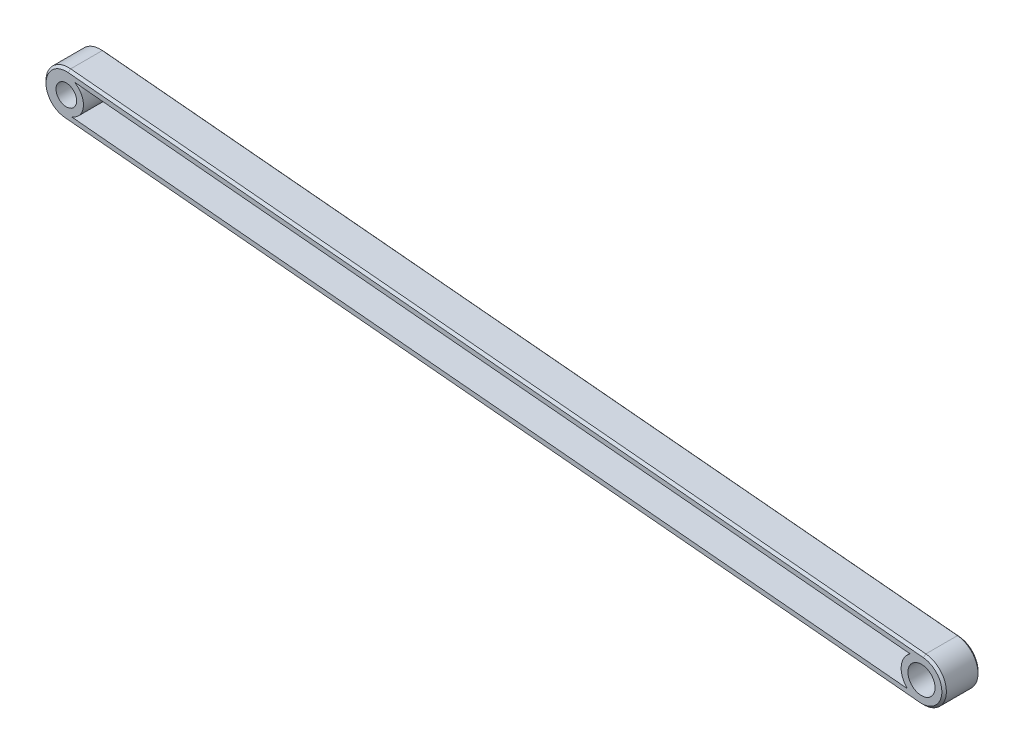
ISO-10303-21;
HEADER;
FILE_DESCRIPTION(('STEP AP214'),'2;1');
FILE_NAME('part.step','',(''),(''),'','','');
FILE_SCHEMA(('AUTOMOTIVE_DESIGN { 1 0 10303 214 1 1 1 1 }'));
ENDSEC;
DATA;
#1=APPLICATION_CONTEXT('core data for automotive mechanical design processes');
#2=APPLICATION_PROTOCOL_DEFINITION('international standard','automotive_design',2000,#1);
#3=PRODUCT_CONTEXT('',#1,'mechanical');
#4=PRODUCT('Part','Part','',(#3));
#5=PRODUCT_RELATED_PRODUCT_CATEGORY('part','',(#4));
#6=PRODUCT_DEFINITION_FORMATION('','',#4);
#7=PRODUCT_DEFINITION_CONTEXT('part definition',#1,'design');
#8=PRODUCT_DEFINITION('design','',#6,#7);
#9=PRODUCT_DEFINITION_SHAPE('','',#8);
#10=(LENGTH_UNIT() NAMED_UNIT(*) SI_UNIT(.MILLI.,.METRE.));
#11=(NAMED_UNIT(*) PLANE_ANGLE_UNIT() SI_UNIT($,.RADIAN.));
#12=(NAMED_UNIT(*) SI_UNIT($,.STERADIAN.) SOLID_ANGLE_UNIT());
#13=UNCERTAINTY_MEASURE_WITH_UNIT(LENGTH_MEASURE(1.E-05),#10,'distance_accuracy_value','');
#14=(GEOMETRIC_REPRESENTATION_CONTEXT(3) GLOBAL_UNCERTAINTY_ASSIGNED_CONTEXT((#13)) GLOBAL_UNIT_ASSIGNED_CONTEXT((#10,
#11,#12)) REPRESENTATION_CONTEXT('',''));
#15=CARTESIAN_POINT('',(0.,0.,0.));
#16=DIRECTION('',(0.,0.,1.));
#17=DIRECTION('',(1.,0.,0.));
#18=AXIS2_PLACEMENT_3D('',#15,#16,#17);
#19=CARTESIAN_POINT('',(517.920389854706,929.84012062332,15.9999999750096));
#20=DIRECTION('',(0.,0.,1.));
#21=DIRECTION('',(0.999913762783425,-0.0131326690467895,0.));
#22=AXIS2_PLACEMENT_3D('',#19,#20,#21);
#23=PLANE('',#22);
#24=CARTESIAN_POINT('',(139.534710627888,964.829738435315,15.9999999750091));
#25=DIRECTION('',(0.,0.,1.));
#26=DIRECTION('',(0.,-1.,0.));
#27=AXIS2_PLACEMENT_3D('',#24,#25,#26);
#28=CIRCLE('',#27,9.00000000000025);
#29=CARTESIAN_POINT('',(140.363412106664,973.791504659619,15.9999999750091));
#30=VERTEX_POINT('',#29);
#31=CARTESIAN_POINT('',(138.706009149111,955.867972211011,15.999999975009));
#32=VERTEX_POINT('',#31);
#33=EDGE_CURVE('E34',#30,#32,#28,.T.);
#34=ORIENTED_EDGE('',*,*,#33,.T.);
#35=DIRECTION('',(0.99575180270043,-0.0920779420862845,0.));
#36=VECTOR('',#35,1.);
#37=CARTESIAN_POINT('',(517.091694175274,920.878354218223,15.9999999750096));
#38=LINE('',#37,#36);
#39=CARTESIAN_POINT('',(517.091694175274,920.878354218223,15.9999999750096));
#40=VERTEX_POINT('',#39);
#41=EDGE_CURVE('E11',#32,#40,#38,.T.);
#42=ORIENTED_EDGE('',*,*,#41,.T.);
#43=CARTESIAN_POINT('',(517.920395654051,929.840120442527,15.9999999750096));
#44=DIRECTION('',(0.,0.,1.));
#45=DIRECTION('',(0.,-1.,0.));
#46=AXIS2_PLACEMENT_3D('',#43,#44,#45);
#47=CIRCLE('',#46,9.00000000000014);
#48=CARTESIAN_POINT('',(518.749097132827,938.801886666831,15.9999999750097));
#49=VERTEX_POINT('',#48);
#50=EDGE_CURVE('E214',#40,#49,#47,.T.);
#51=ORIENTED_EDGE('',*,*,#50,.T.);
#52=DIRECTION('',(-0.99575180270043,0.0920779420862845,0.));
#53=VECTOR('',#52,1.);
#54=CARTESIAN_POINT('',(140.363412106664,973.791504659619,15.9999999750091));
#55=LINE('',#54,#53);
#56=EDGE_CURVE('E212',#49,#30,#55,.T.);
#57=ORIENTED_EDGE('',*,*,#56,.T.);
#58=EDGE_LOOP('',(#34,#42,#51,#57));
#59=FACE_BOUND('',#58,.T.);
#60=CARTESIAN_POINT('',(139.534710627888,964.829738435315,15.9999999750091));
#61=DIRECTION('',(0.,0.,1.));
#62=DIRECTION('',(0.,-1.,0.));
#63=AXIS2_PLACEMENT_3D('',#60,#61,#62);
#64=CIRCLE('',#63,4.57379055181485);
#65=CARTESIAN_POINT('',(139.534710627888,960.2559478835,15.9999999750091));
#66=VERTEX_POINT('',#65);
#67=EDGE_CURVE('E162',#66,#66,#64,.T.);
#68=ORIENTED_EDGE('',*,*,#67,.F.);
#69=EDGE_LOOP('',(#68));
#70=FACE_BOUND('',#69,.T.);
#71=CARTESIAN_POINT('',(517.920395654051,929.840120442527,15.9999999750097));
#72=DIRECTION('',(0.,0.,1.));
#73=DIRECTION('',(0.,-1.,0.));
#74=AXIS2_PLACEMENT_3D('',#71,#72,#73);
#75=CIRCLE('',#74,5.99999999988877);
#76=CARTESIAN_POINT('',(517.920395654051,923.840120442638,15.9999999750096));
#77=VERTEX_POINT('',#76);
#78=EDGE_CURVE('E161',#77,#77,#75,.T.);
#79=ORIENTED_EDGE('',*,*,#78,.F.);
#80=EDGE_LOOP('',(#79));
#81=FACE_BOUND('',#80,.T.);
#82=DIRECTION('',(-0.99575180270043,0.0920779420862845,0.));
#83=VECTOR('',#82,1.);
#84=CARTESIAN_POINT('',(140.179256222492,971.800001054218,15.9999999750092));
#85=LINE('',#84,#83);
#86=CARTESIAN_POINT('',(512.932118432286,937.331254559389,15.9999999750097));
#87=VERTEX_POINT('',#86);
#88=CARTESIAN_POINT('',(143.05873617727,971.533733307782,15.9999999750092));
#89=VERTEX_POINT('',#88);
#90=EDGE_CURVE('E147',#87,#89,#85,.T.);
#91=ORIENTED_EDGE('',*,*,#90,.F.);
#92=CARTESIAN_POINT('',(517.920395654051,929.840120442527,15.9999999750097));
#93=DIRECTION('',(0.,0.,1.));
#94=DIRECTION('',(0.,-1.,0.));
#95=AXIS2_PLACEMENT_3D('',#92,#93,#94);
#96=CIRCLE('',#95,8.99999999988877);
#97=CARTESIAN_POINT('',(511.643027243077,923.390729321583,15.9999999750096));
#98=VERTEX_POINT('',#97);
#99=EDGE_CURVE('E154',#87,#98,#96,.T.);
#100=ORIENTED_EDGE('',*,*,#99,.T.);
#101=DIRECTION('',(0.99575180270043,-0.0920779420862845,0.));
#102=VECTOR('',#101,1.);
#103=CARTESIAN_POINT('',(138.890165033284,957.859475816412,15.9999999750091));
#104=LINE('',#103,#102);
#105=CARTESIAN_POINT('',(141.769644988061,957.593208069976,15.9999999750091));
#106=VERTEX_POINT('',#105);
#107=EDGE_CURVE('E123',#106,#98,#104,.T.);
#108=ORIENTED_EDGE('',*,*,#107,.F.);
#109=CARTESIAN_POINT('',(139.534710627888,964.829738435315,15.9999999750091));
#110=DIRECTION('',(0.,0.,1.));
#111=DIRECTION('',(0.,-1.,0.));
#112=AXIS2_PLACEMENT_3D('',#109,#110,#111);
#113=CIRCLE('',#112,7.57379055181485);
#114=EDGE_CURVE('E150',#106,#89,#113,.T.);
#115=ORIENTED_EDGE('',*,*,#114,.T.);
#116=EDGE_LOOP('',(#91,#100,#108,#115));
#117=FACE_BOUND('',#116,.T.);
#118=ADVANCED_FACE('F26',(#59,#70,#81,#117),#23,.T.);
#119=CARTESIAN_POINT('',(140.45549004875,974.787256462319,418.162917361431));
#120=DIRECTION('',(-0.0920779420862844,-0.995751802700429,0.));
#121=DIRECTION('',(0.99575180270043,-0.0920779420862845,0.));
#122=AXIS2_PLACEMENT_3D('',#119,#120,#121);
#123=PLANE('',#122);
#124=DIRECTION('',(0.,0.,-1.));
#125=VECTOR('',#124,1.);
#126=CARTESIAN_POINT('',(518.841175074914,939.797638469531,418.162917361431));
#127=LINE('',#126,#125);
#128=CARTESIAN_POINT('',(518.841175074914,939.797638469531,14.9999999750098));
#129=VERTEX_POINT('',#128);
#130=CARTESIAN_POINT('',(518.841175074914,939.797638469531,1.));
#131=VERTEX_POINT('',#130);
#132=EDGE_CURVE('E174',#129,#131,#127,.T.);
#133=ORIENTED_EDGE('',*,*,#132,.T.);
#134=DIRECTION('',(-0.99575180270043,0.0920779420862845,0.));
#135=VECTOR('',#134,1.);
#136=CARTESIAN_POINT('',(140.45549004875,974.787256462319,1.));
#137=LINE('',#136,#135);
#138=CARTESIAN_POINT('',(140.45549004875,974.787256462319,1.));
#139=VERTEX_POINT('',#138);
#140=EDGE_CURVE('E210',#131,#139,#137,.T.);
#141=ORIENTED_EDGE('',*,*,#140,.T.);
#142=DIRECTION('',(0.,0.,-1.));
#143=VECTOR('',#142,1.);
#144=CARTESIAN_POINT('',(140.45549004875,974.787256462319,418.162917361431));
#145=LINE('',#144,#143);
#146=CARTESIAN_POINT('',(140.45549004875,974.787256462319,14.9999999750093));
#147=VERTEX_POINT('',#146);
#148=EDGE_CURVE('E171',#147,#139,#145,.T.);
#149=ORIENTED_EDGE('',*,*,#148,.F.);
#150=DIRECTION('',(0.99575180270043,-0.0920779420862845,0.));
#151=VECTOR('',#150,1.);
#152=CARTESIAN_POINT('',(518.841175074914,939.797638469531,14.9999999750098));
#153=LINE('',#152,#151);
#154=EDGE_CURVE('E208',#147,#129,#153,.T.);
#155=ORIENTED_EDGE('',*,*,#154,.T.);
#156=EDGE_LOOP('',(#133,#141,#149,#155));
#157=FACE_BOUND('',#156,.T.);
#158=ADVANCED_FACE('F273',(#157),#123,.F.);
#159=CARTESIAN_POINT('',(517.920395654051,929.840120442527,418.162917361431));
#160=DIRECTION('',(0.,0.,-1.));
#161=DIRECTION('',(-1.,0.,0.));
#162=AXIS2_PLACEMENT_3D('',#159,#160,#161);
#163=CYLINDRICAL_SURFACE('',#162,9.99999999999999);
#164=DIRECTION('',(0.,0.,-1.));
#165=VECTOR('',#164,1.);
#166=CARTESIAN_POINT('',(516.999616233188,919.882602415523,418.162917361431));
#167=LINE('',#166,#165);
#168=CARTESIAN_POINT('',(516.999616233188,919.882602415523,14.9999999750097));
#169=VERTEX_POINT('',#168);
#170=CARTESIAN_POINT('',(516.999616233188,919.882602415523,1.));
#171=VERTEX_POINT('',#170);
#172=EDGE_CURVE('E177',#169,#171,#167,.T.);
#173=ORIENTED_EDGE('',*,*,#172,.T.);
#174=CARTESIAN_POINT('',(517.920395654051,929.840120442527,1.));
#175=DIRECTION('',(0.,0.,1.));
#176=DIRECTION('',(1.,0.,0.));
#177=AXIS2_PLACEMENT_3D('',#174,#175,#176);
#178=CIRCLE('',#177,9.99999999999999);
#179=EDGE_CURVE('E206',#171,#131,#178,.T.);
#180=ORIENTED_EDGE('',*,*,#179,.T.);
#181=ORIENTED_EDGE('',*,*,#132,.F.);
#182=CARTESIAN_POINT('',(517.920395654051,929.840120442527,14.9999999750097));
#183=DIRECTION('',(0.,0.,1.));
#184=DIRECTION('',(1.,0.,0.));
#185=AXIS2_PLACEMENT_3D('',#182,#183,#184);
#186=CIRCLE('',#185,9.99999999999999);
#187=EDGE_CURVE('E204',#129,#169,#186,.F.);
#188=ORIENTED_EDGE('',*,*,#187,.T.);
#189=EDGE_LOOP('',(#173,#180,#181,#188));
#190=FACE_BOUND('',#189,.T.);
#191=ADVANCED_FACE('F271',(#190),#163,.T.);
#192=CARTESIAN_POINT('',(138.613931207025,954.872220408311,418.162917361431));
#193=DIRECTION('',(0.0920779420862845,0.995751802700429,0.));
#194=DIRECTION('',(-0.99575180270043,0.0920779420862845,0.));
#195=AXIS2_PLACEMENT_3D('',#192,#193,#194);
#196=PLANE('',#195);
#197=DIRECTION('',(0.,0.,-1.));
#198=VECTOR('',#197,1.);
#199=CARTESIAN_POINT('',(138.613931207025,954.872220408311,418.162917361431));
#200=LINE('',#199,#198);
#201=CARTESIAN_POINT('',(138.613931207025,954.872220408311,14.9999999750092));
#202=VERTEX_POINT('',#201);
#203=CARTESIAN_POINT('',(138.613931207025,954.872220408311,1.));
#204=VERTEX_POINT('',#203);
#205=EDGE_CURVE('E180',#202,#204,#200,.T.);
#206=ORIENTED_EDGE('',*,*,#205,.T.);
#207=DIRECTION('',(0.99575180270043,-0.0920779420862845,0.));
#208=VECTOR('',#207,1.);
#209=CARTESIAN_POINT('',(138.613931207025,954.872220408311,1.));
#210=LINE('',#209,#208);
#211=EDGE_CURVE('E188',#204,#171,#210,.T.);
#212=ORIENTED_EDGE('',*,*,#211,.T.);
#213=ORIENTED_EDGE('',*,*,#172,.F.);
#214=DIRECTION('',(-0.99575180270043,0.0920779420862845,0.));
#215=VECTOR('',#214,1.);
#216=CARTESIAN_POINT('',(138.613931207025,954.872220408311,14.9999999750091));
#217=LINE('',#216,#215);
#218=EDGE_CURVE('E183',#169,#202,#217,.T.);
#219=ORIENTED_EDGE('',*,*,#218,.T.);
#220=EDGE_LOOP('',(#206,#212,#213,#219));
#221=FACE_BOUND('',#220,.T.);
#222=ADVANCED_FACE('F269',(#221),#196,.F.);
#223=CARTESIAN_POINT('',(139.534710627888,964.829738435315,418.162917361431));
#224=DIRECTION('',(0.,0.,-1.));
#225=DIRECTION('',(-1.,0.,0.));
#226=AXIS2_PLACEMENT_3D('',#223,#224,#225);
#227=CYLINDRICAL_SURFACE('',#226,9.99999999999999);
#228=ORIENTED_EDGE('',*,*,#148,.T.);
#229=CARTESIAN_POINT('',(139.534710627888,964.829738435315,1.));
#230=DIRECTION('',(0.,0.,1.));
#231=DIRECTION('',(1.,0.,0.));
#232=AXIS2_PLACEMENT_3D('',#229,#230,#231);
#233=CIRCLE('',#232,9.99999999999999);
#234=EDGE_CURVE('E202',#139,#204,#233,.T.);
#235=ORIENTED_EDGE('',*,*,#234,.T.);
#236=ORIENTED_EDGE('',*,*,#205,.F.);
#237=CARTESIAN_POINT('',(139.534710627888,964.829738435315,14.9999999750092));
#238=DIRECTION('',(0.,0.,1.));
#239=DIRECTION('',(1.,0.,0.));
#240=AXIS2_PLACEMENT_3D('',#237,#238,#239);
#241=CIRCLE('',#240,9.99999999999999);
#242=EDGE_CURVE('E200',#202,#147,#241,.F.);
#243=ORIENTED_EDGE('',*,*,#242,.T.);
#244=EDGE_LOOP('',(#228,#235,#236,#243));
#245=FACE_BOUND('',#244,.T.);
#246=ADVANCED_FACE('F28',(#245),#227,.T.);
#247=CARTESIAN_POINT('',(139.534710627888,964.829738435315,418.162917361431));
#248=DIRECTION('',(0.,0.,-1.));
#249=DIRECTION('',(-1.,0.,0.));
#250=AXIS2_PLACEMENT_3D('',#247,#248,#249);
#251=CYLINDRICAL_SURFACE('',#250,4.57379055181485);
#252=CARTESIAN_POINT('',(139.534710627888,964.829738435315,0.));
#253=DIRECTION('',(0.,0.,1.));
#254=DIRECTION('',(1.,0.,0.));
#255=AXIS2_PLACEMENT_3D('',#252,#253,#254);
#256=CIRCLE('',#255,4.57379055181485);
#257=CARTESIAN_POINT('',(144.108501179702,964.829738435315,0.));
#258=VERTEX_POINT('',#257);
#259=EDGE_CURVE('E168',#258,#258,#256,.T.);
#260=ORIENTED_EDGE('',*,*,#259,.F.);
#261=EDGE_LOOP('',(#260));
#262=FACE_BOUND('',#261,.T.);
#263=ORIENTED_EDGE('',*,*,#67,.T.);
#264=EDGE_LOOP('',(#263));
#265=FACE_BOUND('',#264,.T.);
#266=ADVANCED_FACE('F300',(#262,#265),#251,.F.);
#267=CARTESIAN_POINT('',(139.534710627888,964.829738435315,0.));
#268=DIRECTION('',(0.,0.,1.));
#269=DIRECTION('',(1.,0.,0.));
#270=AXIS2_PLACEMENT_3D('',#267,#268,#269);
#271=PLANE('',#270);
#272=CARTESIAN_POINT('',(517.920395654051,929.840120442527,0.));
#273=DIRECTION('',(0.,0.,1.));
#274=DIRECTION('',(1.,0.,0.));
#275=AXIS2_PLACEMENT_3D('',#272,#273,#274);
#276=CIRCLE('',#275,8.99999999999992);
#277=CARTESIAN_POINT('',(518.749097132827,938.801886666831,0.));
#278=VERTEX_POINT('',#277);
#279=CARTESIAN_POINT('',(517.091694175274,920.878354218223,0.));
#280=VERTEX_POINT('',#279);
#281=EDGE_CURVE('E193',#278,#280,#276,.F.);
#282=ORIENTED_EDGE('',*,*,#281,.T.);
#283=DIRECTION('',(-0.99575180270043,0.0920779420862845,0.));
#284=VECTOR('',#283,1.);
#285=CARTESIAN_POINT('',(138.706009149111,955.867972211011,0.));
#286=LINE('',#285,#284);
#287=CARTESIAN_POINT('',(138.706009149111,955.867972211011,0.));
#288=VERTEX_POINT('',#287);
#289=EDGE_CURVE('E197',#280,#288,#286,.T.);
#290=ORIENTED_EDGE('',*,*,#289,.T.);
#291=CARTESIAN_POINT('',(139.534710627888,964.829738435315,0.));
#292=DIRECTION('',(0.,0.,1.));
#293=DIRECTION('',(1.,0.,0.));
#294=AXIS2_PLACEMENT_3D('',#291,#292,#293);
#295=CIRCLE('',#294,8.99999999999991);
#296=CARTESIAN_POINT('',(140.363412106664,973.791504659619,0.));
#297=VERTEX_POINT('',#296);
#298=EDGE_CURVE('E195',#288,#297,#295,.F.);
#299=ORIENTED_EDGE('',*,*,#298,.T.);
#300=DIRECTION('',(0.99575180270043,-0.0920779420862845,0.));
#301=VECTOR('',#300,1.);
#302=CARTESIAN_POINT('',(140.363412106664,973.791504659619,0.));
#303=LINE('',#302,#301);
#304=EDGE_CURVE('E191',#297,#278,#303,.T.);
#305=ORIENTED_EDGE('',*,*,#304,.T.);
#306=EDGE_LOOP('',(#282,#290,#299,#305));
#307=FACE_BOUND('',#306,.T.);
#308=ORIENTED_EDGE('',*,*,#259,.T.);
#309=EDGE_LOOP('',(#308));
#310=FACE_BOUND('',#309,.T.);
#311=CARTESIAN_POINT('',(517.920395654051,929.840120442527,0.));
#312=DIRECTION('',(0.,0.,1.));
#313=DIRECTION('',(1.,0.,0.));
#314=AXIS2_PLACEMENT_3D('',#311,#312,#313);
#315=CIRCLE('',#314,5.99999999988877);
#316=CARTESIAN_POINT('',(523.920395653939,929.840120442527,0.));
#317=VERTEX_POINT('',#316);
#318=EDGE_CURVE('E165',#317,#317,#315,.T.);
#319=ORIENTED_EDGE('',*,*,#318,.T.);
#320=EDGE_LOOP('',(#319));
#321=FACE_BOUND('',#320,.T.);
#322=ADVANCED_FACE('F255',(#307,#310,#321),#271,.F.);
#323=CARTESIAN_POINT('',(517.920395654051,929.840120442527,418.162917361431));
#324=DIRECTION('',(0.,0.,-1.));
#325=DIRECTION('',(-1.,0.,0.));
#326=AXIS2_PLACEMENT_3D('',#323,#324,#325);
#327=CYLINDRICAL_SURFACE('',#326,5.99999999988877);
#328=ORIENTED_EDGE('',*,*,#318,.F.);
#329=EDGE_LOOP('',(#328));
#330=FACE_BOUND('',#329,.T.);
#331=ORIENTED_EDGE('',*,*,#78,.T.);
#332=EDGE_LOOP('',(#331));
#333=FACE_BOUND('',#332,.T.);
#334=ADVANCED_FACE('F295',(#330,#333),#327,.F.);
#335=CARTESIAN_POINT('',(140.179256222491,971.800001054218,418.162917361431));
#336=DIRECTION('',(-0.0920779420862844,-0.995751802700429,0.));
#337=DIRECTION('',(0.99575180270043,-0.0920779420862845,0.));
#338=AXIS2_PLACEMENT_3D('',#335,#336,#337);
#339=PLANE('',#338);
#340=DIRECTION('',(-0.99575180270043,0.0920779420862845,0.));
#341=VECTOR('',#340,1.);
#342=CARTESIAN_POINT('',(140.179256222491,971.800001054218,3.));
#343=LINE('',#342,#341);
#344=CARTESIAN_POINT('',(512.932118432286,937.331254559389,3.));
#345=VERTEX_POINT('',#344);
#346=CARTESIAN_POINT('',(143.05873617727,971.533733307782,3.));
#347=VERTEX_POINT('',#346);
#348=EDGE_CURVE('E141',#345,#347,#343,.T.);
#349=ORIENTED_EDGE('',*,*,#348,.F.);
#350=DIRECTION('',(0.,0.,-1.));
#351=VECTOR('',#350,1.);
#352=CARTESIAN_POINT('',(512.932118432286,937.331254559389,418.162917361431));
#353=LINE('',#352,#351);
#354=EDGE_CURVE('E128',#345,#87,#353,.F.);
#355=ORIENTED_EDGE('',*,*,#354,.T.);
#356=ORIENTED_EDGE('',*,*,#90,.T.);
#357=DIRECTION('',(0.,0.,-1.));
#358=VECTOR('',#357,1.);
#359=CARTESIAN_POINT('',(143.05873617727,971.533733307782,418.162917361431));
#360=LINE('',#359,#358);
#361=EDGE_CURVE('E127',#347,#89,#360,.F.);
#362=ORIENTED_EDGE('',*,*,#361,.F.);
#363=EDGE_LOOP('',(#349,#355,#356,#362));
#364=FACE_BOUND('',#363,.T.);
#365=ADVANCED_FACE('F298',(#364),#339,.T.);
#366=CARTESIAN_POINT('',(138.890165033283,957.859475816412,418.162917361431));
#367=DIRECTION('',(0.0920779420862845,0.995751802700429,0.));
#368=DIRECTION('',(-0.99575180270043,0.0920779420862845,0.));
#369=AXIS2_PLACEMENT_3D('',#366,#367,#368);
#370=PLANE('',#369);
#371=DIRECTION('',(0.,0.,-1.));
#372=VECTOR('',#371,1.);
#373=CARTESIAN_POINT('',(141.769644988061,957.593208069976,418.162917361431));
#374=LINE('',#373,#372);
#375=CARTESIAN_POINT('',(141.769644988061,957.593208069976,3.));
#376=VERTEX_POINT('',#375);
#377=EDGE_CURVE('E159',#376,#106,#374,.F.);
#378=ORIENTED_EDGE('',*,*,#377,.T.);
#379=ORIENTED_EDGE('',*,*,#107,.T.);
#380=DIRECTION('',(0.,0.,-1.));
#381=VECTOR('',#380,1.);
#382=CARTESIAN_POINT('',(511.643027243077,923.390729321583,418.162917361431));
#383=LINE('',#382,#381);
#384=CARTESIAN_POINT('',(511.643027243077,923.390729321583,3.));
#385=VERTEX_POINT('',#384);
#386=EDGE_CURVE('E116',#385,#98,#383,.F.);
#387=ORIENTED_EDGE('',*,*,#386,.F.);
#388=DIRECTION('',(0.99575180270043,-0.0920779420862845,0.));
#389=VECTOR('',#388,1.);
#390=CARTESIAN_POINT('',(138.890165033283,957.859475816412,3.));
#391=LINE('',#390,#389);
#392=EDGE_CURVE('E121',#376,#385,#391,.T.);
#393=ORIENTED_EDGE('',*,*,#392,.F.);
#394=EDGE_LOOP('',(#378,#379,#387,#393));
#395=FACE_BOUND('',#394,.T.);
#396=ADVANCED_FACE('F119',(#395),#370,.T.);
#397=CARTESIAN_POINT('',(139.534710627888,964.829738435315,418.162917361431));
#398=DIRECTION('',(0.,0.,-1.));
#399=DIRECTION('',(-1.,0.,0.));
#400=AXIS2_PLACEMENT_3D('',#397,#398,#399);
#401=CYLINDRICAL_SURFACE('',#400,7.57379055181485);
#402=CARTESIAN_POINT('',(139.534710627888,964.829738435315,3.));
#403=DIRECTION('',(0.,0.,1.));
#404=DIRECTION('',(1.,0.,0.));
#405=AXIS2_PLACEMENT_3D('',#402,#403,#404);
#406=CIRCLE('',#405,7.57379055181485);
#407=EDGE_CURVE('E136',#376,#347,#406,.T.);
#408=ORIENTED_EDGE('',*,*,#407,.T.);
#409=ORIENTED_EDGE('',*,*,#361,.T.);
#410=ORIENTED_EDGE('',*,*,#114,.F.);
#411=ORIENTED_EDGE('',*,*,#377,.F.);
#412=EDGE_LOOP('',(#408,#409,#410,#411));
#413=FACE_BOUND('',#412,.T.);
#414=ADVANCED_FACE('F371',(#413),#401,.T.);
#415=CARTESIAN_POINT('',(139.534710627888,964.829738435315,3.));
#416=DIRECTION('',(0.,0.,1.));
#417=DIRECTION('',(1.,0.,0.));
#418=AXIS2_PLACEMENT_3D('',#415,#416,#417);
#419=PLANE('',#418);
#420=ORIENTED_EDGE('',*,*,#407,.F.);
#421=ORIENTED_EDGE('',*,*,#392,.T.);
#422=CARTESIAN_POINT('',(517.920395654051,929.840120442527,3.));
#423=DIRECTION('',(0.,0.,1.));
#424=DIRECTION('',(1.,0.,0.));
#425=AXIS2_PLACEMENT_3D('',#422,#423,#424);
#426=CIRCLE('',#425,8.99999999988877);
#427=EDGE_CURVE('E131',#345,#385,#426,.T.);
#428=ORIENTED_EDGE('',*,*,#427,.F.);
#429=ORIENTED_EDGE('',*,*,#348,.T.);
#430=EDGE_LOOP('',(#420,#421,#428,#429));
#431=FACE_BOUND('',#430,.T.);
#432=ADVANCED_FACE('F139',(#431),#419,.T.);
#433=CARTESIAN_POINT('',(517.920395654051,929.840120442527,418.162917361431));
#434=DIRECTION('',(0.,0.,-1.));
#435=DIRECTION('',(-1.,0.,0.));
#436=AXIS2_PLACEMENT_3D('',#433,#434,#435);
#437=CYLINDRICAL_SURFACE('',#436,8.99999999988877);
#438=ORIENTED_EDGE('',*,*,#386,.T.);
#439=ORIENTED_EDGE('',*,*,#99,.F.);
#440=ORIENTED_EDGE('',*,*,#354,.F.);
#441=ORIENTED_EDGE('',*,*,#427,.T.);
#442=EDGE_LOOP('',(#438,#439,#440,#441));
#443=FACE_BOUND('',#442,.T.);
#444=ADVANCED_FACE('F132',(#443),#437,.T.);
#445=CARTESIAN_POINT('',(140.45549004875,974.787256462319,1.));
#446=DIRECTION('',(-0.0651089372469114,-0.704102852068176,0.707106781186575));
#447=DIRECTION('',(0.,-0.708610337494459,-0.705600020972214));
#448=AXIS2_PLACEMENT_3D('',#445,#446,#447);
#449=PLANE('',#448);
#450=DIRECTION('',(0.0651089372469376,0.704102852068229,0.707106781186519));
#451=VECTOR('',#450,1.);
#452=CARTESIAN_POINT('',(518.749097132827,938.801886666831,0.));
#453=LINE('',#452,#451);
#454=EDGE_CURVE('E239',#278,#131,#453,.T.);
#455=ORIENTED_EDGE('',*,*,#454,.F.);
#456=ORIENTED_EDGE('',*,*,#304,.F.);
#457=DIRECTION('',(-0.065108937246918,-0.70410285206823,-0.70710678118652));
#458=VECTOR('',#457,1.);
#459=CARTESIAN_POINT('',(140.45549004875,974.787256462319,1.));
#460=LINE('',#459,#458);
#461=EDGE_CURVE('E156',#139,#297,#460,.T.);
#462=ORIENTED_EDGE('',*,*,#461,.F.);
#463=ORIENTED_EDGE('',*,*,#140,.F.);
#464=EDGE_LOOP('',(#455,#456,#462,#463));
#465=FACE_BOUND('',#464,.T.);
#466=ADVANCED_FACE('F252',(#465),#449,.F.);
#467=CARTESIAN_POINT('',(139.534710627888,964.829738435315,1.));
#468=DIRECTION('',(0.,0.,1.));
#469=DIRECTION('',(1.,0.,0.));
#470=AXIS2_PLACEMENT_3D('',#467,#468,#469);
#471=CONICAL_SURFACE('',#470,9.99999999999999,0.785398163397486);
#472=ORIENTED_EDGE('',*,*,#461,.T.);
#473=ORIENTED_EDGE('',*,*,#298,.F.);
#474=DIRECTION('',(0.065108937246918,0.70410285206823,-0.70710678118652));
#475=VECTOR('',#474,1.);
#476=CARTESIAN_POINT('',(138.613931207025,954.872220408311,1.));
#477=LINE('',#476,#475);
#478=EDGE_CURVE('E237',#204,#288,#477,.T.);
#479=ORIENTED_EDGE('',*,*,#478,.F.);
#480=ORIENTED_EDGE('',*,*,#234,.F.);
#481=EDGE_LOOP('',(#472,#473,#479,#480));
#482=FACE_BOUND('',#481,.T.);
#483=ADVANCED_FACE('F246',(#482),#471,.T.);
#484=CARTESIAN_POINT('',(517.920395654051,929.840120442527,1.));
#485=DIRECTION('',(0.,0.,1.));
#486=DIRECTION('',(1.,0.,0.));
#487=AXIS2_PLACEMENT_3D('',#484,#485,#486);
#488=CONICAL_SURFACE('',#487,9.99999999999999,0.785398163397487);
#489=ORIENTED_EDGE('',*,*,#454,.T.);
#490=ORIENTED_EDGE('',*,*,#179,.F.);
#491=DIRECTION('',(-0.0651089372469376,-0.704102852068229,0.707106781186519));
#492=VECTOR('',#491,1.);
#493=CARTESIAN_POINT('',(517.091694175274,920.878354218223,0.));
#494=LINE('',#493,#492);
#495=EDGE_CURVE('E231',#280,#171,#494,.T.);
#496=ORIENTED_EDGE('',*,*,#495,.F.);
#497=ORIENTED_EDGE('',*,*,#281,.F.);
#498=EDGE_LOOP('',(#489,#490,#496,#497));
#499=FACE_BOUND('',#498,.T.);
#500=ADVANCED_FACE('F264',(#499),#488,.T.);
#501=CARTESIAN_POINT('',(138.613931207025,954.872220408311,1.));
#502=DIRECTION('',(0.0651089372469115,0.704102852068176,0.707106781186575));
#503=DIRECTION('',(0.,-0.708610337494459,0.705600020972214));
#504=AXIS2_PLACEMENT_3D('',#501,#502,#503);
#505=PLANE('',#504);
#506=ORIENTED_EDGE('',*,*,#478,.T.);
#507=ORIENTED_EDGE('',*,*,#289,.F.);
#508=ORIENTED_EDGE('',*,*,#495,.T.);
#509=ORIENTED_EDGE('',*,*,#211,.F.);
#510=EDGE_LOOP('',(#506,#507,#508,#509));
#511=FACE_BOUND('',#510,.T.);
#512=ADVANCED_FACE('F260',(#511),#505,.F.);
#513=CARTESIAN_POINT('',(518.749091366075,938.801887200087,15.9999999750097));
#514=DIRECTION('',(0.0651089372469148,0.704102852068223,0.707106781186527));
#515=DIRECTION('',(0.,-0.708610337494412,0.705600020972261));
#516=AXIS2_PLACEMENT_3D('',#513,#514,#515);
#517=PLANE('',#516);
#518=DIRECTION('',(-0.0651089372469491,-0.704102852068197,0.707106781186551));
#519=VECTOR('',#518,1.);
#520=CARTESIAN_POINT('',(518.841175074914,939.797638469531,14.9999999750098));
#521=LINE('',#520,#519);
#522=EDGE_CURVE('E224',#129,#49,#521,.T.);
#523=ORIENTED_EDGE('',*,*,#522,.F.);
#524=ORIENTED_EDGE('',*,*,#154,.F.);
#525=DIRECTION('',(0.0651089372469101,0.704102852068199,-0.707106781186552));
#526=VECTOR('',#525,1.);
#527=CARTESIAN_POINT('',(140.363412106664,973.791504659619,15.9999999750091));
#528=LINE('',#527,#526);
#529=EDGE_CURVE('E227',#30,#147,#528,.T.);
#530=ORIENTED_EDGE('',*,*,#529,.F.);
#531=ORIENTED_EDGE('',*,*,#56,.F.);
#532=EDGE_LOOP('',(#523,#524,#530,#531));
#533=FACE_BOUND('',#532,.T.);
#534=ADVANCED_FACE('F222',(#533),#517,.T.);
#535=CARTESIAN_POINT('',(139.534710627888,964.829738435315,15.9999999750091));
#536=DIRECTION('',(0.,0.,-1.));
#537=DIRECTION('',(-1.,0.,0.));
#538=AXIS2_PLACEMENT_3D('',#535,#536,#537);
#539=CONICAL_SURFACE('',#538,9.00000000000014,0.785398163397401);
#540=ORIENTED_EDGE('',*,*,#529,.T.);
#541=ORIENTED_EDGE('',*,*,#242,.F.);
#542=DIRECTION('',(-0.0651089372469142,-0.704102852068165,-0.707106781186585));
#543=VECTOR('',#542,1.);
#544=CARTESIAN_POINT('',(138.706009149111,955.867972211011,15.999999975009));
#545=LINE('',#544,#543);
#546=EDGE_CURVE('E229',#32,#202,#545,.T.);
#547=ORIENTED_EDGE('',*,*,#546,.F.);
#548=ORIENTED_EDGE('',*,*,#33,.F.);
#549=EDGE_LOOP('',(#540,#541,#547,#548));
#550=FACE_BOUND('',#549,.T.);
#551=ADVANCED_FACE('F277',(#550),#539,.T.);
#552=CARTESIAN_POINT('',(517.920395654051,929.840120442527,15.9999999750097));
#553=DIRECTION('',(0.,0.,-1.));
#554=DIRECTION('',(-1.,0.,0.));
#555=AXIS2_PLACEMENT_3D('',#552,#553,#554);
#556=CONICAL_SURFACE('',#555,9.00000000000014,0.785398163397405);
#557=ORIENTED_EDGE('',*,*,#522,.T.);
#558=ORIENTED_EDGE('',*,*,#50,.F.);
#559=DIRECTION('',(0.0651089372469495,0.704102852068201,0.707106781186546));
#560=VECTOR('',#559,1.);
#561=CARTESIAN_POINT('',(516.999616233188,919.882602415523,14.9999999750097));
#562=LINE('',#561,#560);
#563=EDGE_CURVE('E47',#169,#40,#562,.T.);
#564=ORIENTED_EDGE('',*,*,#563,.F.);
#565=ORIENTED_EDGE('',*,*,#187,.F.);
#566=EDGE_LOOP('',(#557,#558,#564,#565));
#567=FACE_BOUND('',#566,.T.);
#568=ADVANCED_FACE('F228',(#567),#556,.T.);
#569=CARTESIAN_POINT('',(517.091688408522,920.878354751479,15.9999999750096));
#570=DIRECTION('',(-0.06510893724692,-0.704102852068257,0.707106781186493));
#571=DIRECTION('',(0.,-0.708610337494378,-0.705600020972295));
#572=AXIS2_PLACEMENT_3D('',#569,#570,#571);
#573=PLANE('',#572);
#574=ORIENTED_EDGE('',*,*,#546,.T.);
#575=ORIENTED_EDGE('',*,*,#218,.F.);
#576=ORIENTED_EDGE('',*,*,#563,.T.);
#577=ORIENTED_EDGE('',*,*,#41,.F.);
#578=EDGE_LOOP('',(#574,#575,#576,#577));
#579=FACE_BOUND('',#578,.T.);
#580=ADVANCED_FACE('F278',(#579),#573,.T.);
#581=CLOSED_SHELL('',(#118,#158,#191,#222,#246,#266,#322,#334,#365,#396,#414,#432,#444,#466,
#483,#500,#512,#534,#551,#568,#580));
#582=MANIFOLD_SOLID_BREP('B2',#581);
#583=ADVANCED_BREP_SHAPE_REPRESENTATION('',(#18,#582),#14);
#584=SHAPE_DEFINITION_REPRESENTATION(#9,#583);
ENDSEC;
END-ISO-10303-21;
